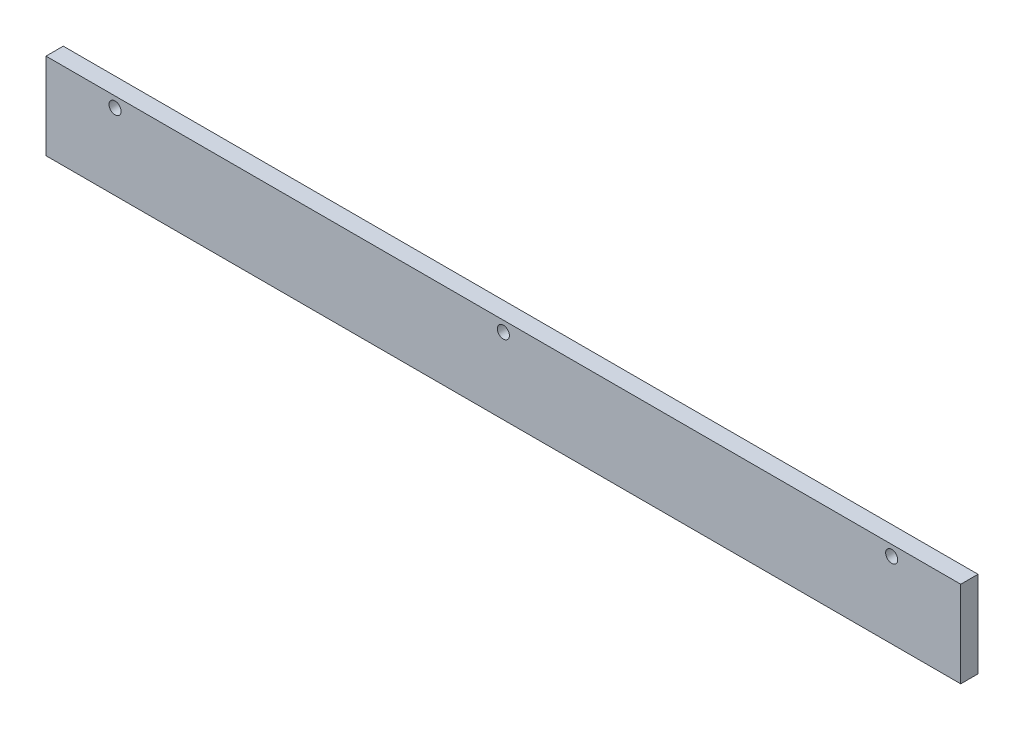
ISO-10303-21;
HEADER;
FILE_DESCRIPTION(('STEP AP214'),'2;1');
FILE_NAME('part.step','',(''),(''),'','','');
FILE_SCHEMA(('AUTOMOTIVE_DESIGN { 1 0 10303 214 1 1 1 1 }'));
ENDSEC;
DATA;
#1=APPLICATION_CONTEXT('core data for automotive mechanical design processes');
#2=APPLICATION_PROTOCOL_DEFINITION('international standard','automotive_design',2000,#1);
#3=PRODUCT_CONTEXT('',#1,'mechanical');
#4=PRODUCT('Part','Part','',(#3));
#5=PRODUCT_RELATED_PRODUCT_CATEGORY('part','',(#4));
#6=PRODUCT_DEFINITION_FORMATION('','',#4);
#7=PRODUCT_DEFINITION_CONTEXT('part definition',#1,'design');
#8=PRODUCT_DEFINITION('design','',#6,#7);
#9=PRODUCT_DEFINITION_SHAPE('','',#8);
#10=(LENGTH_UNIT() NAMED_UNIT(*) SI_UNIT(.MILLI.,.METRE.));
#11=(NAMED_UNIT(*) PLANE_ANGLE_UNIT() SI_UNIT($,.RADIAN.));
#12=(NAMED_UNIT(*) SI_UNIT($,.STERADIAN.) SOLID_ANGLE_UNIT());
#13=UNCERTAINTY_MEASURE_WITH_UNIT(LENGTH_MEASURE(1.E-05),#10,'distance_accuracy_value','');
#14=(GEOMETRIC_REPRESENTATION_CONTEXT(3) GLOBAL_UNCERTAINTY_ASSIGNED_CONTEXT((#13)) GLOBAL_UNIT_ASSIGNED_CONTEXT((#10,
#11,#12)) REPRESENTATION_CONTEXT('',''));
#15=CARTESIAN_POINT('',(0.,0.,0.));
#16=DIRECTION('',(0.,0.,1.));
#17=DIRECTION('',(1.,0.,0.));
#18=AXIS2_PLACEMENT_3D('',#15,#16,#17);
#19=CARTESIAN_POINT('',(-302.,34.802471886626,5.));
#20=DIRECTION('',(1.,0.,0.));
#21=DIRECTION('',(0.,0.,-1.));
#22=AXIS2_PLACEMENT_3D('',#19,#20,#21);
#23=PLANE('',#22);
#24=DIRECTION('',(0.,-1.,0.));
#25=VECTOR('',#24,1.);
#26=CARTESIAN_POINT('',(-302.,34.802471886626,0.));
#27=LINE('',#26,#25);
#28=CARTESIAN_POINT('',(-302.,34.802471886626,0.));
#29=VERTEX_POINT('',#28);
#30=CARTESIAN_POINT('',(-302.,9.80247188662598,0.));
#31=VERTEX_POINT('',#30);
#32=EDGE_CURVE('E79',#29,#31,#27,.T.);
#33=ORIENTED_EDGE('',*,*,#32,.T.);
#34=DIRECTION('',(0.,0.,-1.));
#35=VECTOR('',#34,1.);
#36=CARTESIAN_POINT('',(-302.,9.80247188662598,5.));
#37=LINE('',#36,#35);
#38=CARTESIAN_POINT('',(-302.,9.80247188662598,5.));
#39=VERTEX_POINT('',#38);
#40=EDGE_CURVE('E11',#39,#31,#37,.T.);
#41=ORIENTED_EDGE('',*,*,#40,.F.);
#42=DIRECTION('',(0.,-1.,0.));
#43=VECTOR('',#42,1.);
#44=CARTESIAN_POINT('',(-302.,34.802471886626,5.));
#45=LINE('',#44,#43);
#46=CARTESIAN_POINT('',(-302.,34.802471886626,5.));
#47=VERTEX_POINT('',#46);
#48=EDGE_CURVE('E67',#47,#39,#45,.T.);
#49=ORIENTED_EDGE('',*,*,#48,.F.);
#50=DIRECTION('',(0.,0.,-1.));
#51=VECTOR('',#50,1.);
#52=CARTESIAN_POINT('',(-302.,34.802471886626,5.));
#53=LINE('',#52,#51);
#54=EDGE_CURVE('E75',#47,#29,#53,.T.);
#55=ORIENTED_EDGE('',*,*,#54,.T.);
#56=EDGE_LOOP('',(#33,#41,#49,#55));
#57=FACE_BOUND('',#56,.T.);
#58=ADVANCED_FACE('F16',(#57),#23,.F.);
#59=CARTESIAN_POINT('',(-302.,9.80247188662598,5.));
#60=DIRECTION('',(0.,1.,0.));
#61=DIRECTION('',(0.,0.,1.));
#62=AXIS2_PLACEMENT_3D('',#59,#60,#61);
#63=PLANE('',#62);
#64=DIRECTION('',(1.,0.,0.));
#65=VECTOR('',#64,1.);
#66=CARTESIAN_POINT('',(-302.,9.80247188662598,0.));
#67=LINE('',#66,#65);
#68=CARTESIAN_POINT('',(-37.,9.80247188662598,0.));
#69=VERTEX_POINT('',#68);
#70=EDGE_CURVE('E71',#31,#69,#67,.T.);
#71=ORIENTED_EDGE('',*,*,#70,.T.);
#72=DIRECTION('',(0.,0.,-1.));
#73=VECTOR('',#72,1.);
#74=CARTESIAN_POINT('',(-37.,9.80247188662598,5.));
#75=LINE('',#74,#73);
#76=CARTESIAN_POINT('',(-37.,9.80247188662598,5.));
#77=VERTEX_POINT('',#76);
#78=EDGE_CURVE('E24',#77,#69,#75,.T.);
#79=ORIENTED_EDGE('',*,*,#78,.F.);
#80=DIRECTION('',(1.,0.,0.));
#81=VECTOR('',#80,1.);
#82=CARTESIAN_POINT('',(-302.,9.80247188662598,5.));
#83=LINE('',#82,#81);
#84=EDGE_CURVE('E62',#39,#77,#83,.T.);
#85=ORIENTED_EDGE('',*,*,#84,.F.);
#86=ORIENTED_EDGE('',*,*,#40,.T.);
#87=EDGE_LOOP('',(#71,#79,#85,#86));
#88=FACE_BOUND('',#87,.T.);
#89=ADVANCED_FACE('F70',(#88),#63,.F.);
#90=CARTESIAN_POINT('',(-37.,34.802471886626,5.));
#91=DIRECTION('',(-1.,0.,0.));
#92=DIRECTION('',(0.,0.,1.));
#93=AXIS2_PLACEMENT_3D('',#90,#91,#92);
#94=PLANE('',#93);
#95=DIRECTION('',(0.,1.,0.));
#96=VECTOR('',#95,1.);
#97=CARTESIAN_POINT('',(-37.,34.802471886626,0.));
#98=LINE('',#97,#96);
#99=CARTESIAN_POINT('',(-37.,34.802471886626,0.));
#100=VERTEX_POINT('',#99);
#101=EDGE_CURVE('E49',#69,#100,#98,.T.);
#102=ORIENTED_EDGE('',*,*,#101,.T.);
#103=DIRECTION('',(0.,0.,-1.));
#104=VECTOR('',#103,1.);
#105=CARTESIAN_POINT('',(-37.,34.802471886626,5.));
#106=LINE('',#105,#104);
#107=CARTESIAN_POINT('',(-37.,34.802471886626,5.));
#108=VERTEX_POINT('',#107);
#109=EDGE_CURVE('E72',#108,#100,#106,.T.);
#110=ORIENTED_EDGE('',*,*,#109,.F.);
#111=DIRECTION('',(0.,1.,0.));
#112=VECTOR('',#111,1.);
#113=CARTESIAN_POINT('',(-37.,34.802471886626,5.));
#114=LINE('',#113,#112);
#115=EDGE_CURVE('E65',#77,#108,#114,.T.);
#116=ORIENTED_EDGE('',*,*,#115,.F.);
#117=ORIENTED_EDGE('',*,*,#78,.T.);
#118=EDGE_LOOP('',(#102,#110,#116,#117));
#119=FACE_BOUND('',#118,.T.);
#120=ADVANCED_FACE('F73',(#119),#94,.F.);
#121=CARTESIAN_POINT('',(-302.,34.802471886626,5.));
#122=DIRECTION('',(0.,-1.,0.));
#123=DIRECTION('',(0.,0.,-1.));
#124=AXIS2_PLACEMENT_3D('',#121,#122,#123);
#125=PLANE('',#124);
#126=DIRECTION('',(-1.,0.,0.));
#127=VECTOR('',#126,1.);
#128=CARTESIAN_POINT('',(-302.,34.802471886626,0.));
#129=LINE('',#128,#127);
#130=EDGE_CURVE('E55',#100,#29,#129,.T.);
#131=ORIENTED_EDGE('',*,*,#130,.T.);
#132=ORIENTED_EDGE('',*,*,#54,.F.);
#133=DIRECTION('',(-1.,0.,0.));
#134=VECTOR('',#133,1.);
#135=CARTESIAN_POINT('',(-302.,34.802471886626,5.));
#136=LINE('',#135,#134);
#137=EDGE_CURVE('E32',#108,#47,#136,.T.);
#138=ORIENTED_EDGE('',*,*,#137,.F.);
#139=ORIENTED_EDGE('',*,*,#109,.T.);
#140=EDGE_LOOP('',(#131,#132,#138,#139));
#141=FACE_BOUND('',#140,.T.);
#142=ADVANCED_FACE('F87',(#141),#125,.F.);
#143=CARTESIAN_POINT('',(0.,0.,5.));
#144=DIRECTION('',(0.,0.,1.));
#145=DIRECTION('',(1.,0.,0.));
#146=AXIS2_PLACEMENT_3D('',#143,#144,#145);
#147=PLANE('',#146);
#148=CARTESIAN_POINT('',(-282.,31.802471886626,5.));
#149=DIRECTION('',(0.,0.,1.));
#150=DIRECTION('',(1.,0.,0.));
#151=AXIS2_PLACEMENT_3D('',#148,#149,#150);
#152=CIRCLE('',#151,1.74999999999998);
#153=CARTESIAN_POINT('',(-280.25,31.802471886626,5.));
#154=VERTEX_POINT('',#153);
#155=EDGE_CURVE('E107',#154,#154,#152,.T.);
#156=ORIENTED_EDGE('',*,*,#155,.F.);
#157=EDGE_LOOP('',(#156));
#158=FACE_BOUND('',#157,.T.);
#159=CARTESIAN_POINT('',(-169.5,31.802471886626,5.));
#160=DIRECTION('',(0.,0.,1.));
#161=DIRECTION('',(1.,0.,0.));
#162=AXIS2_PLACEMENT_3D('',#159,#160,#161);
#163=CIRCLE('',#162,1.75);
#164=CARTESIAN_POINT('',(-167.75,31.802471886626,5.));
#165=VERTEX_POINT('',#164);
#166=EDGE_CURVE('E101',#165,#165,#163,.T.);
#167=ORIENTED_EDGE('',*,*,#166,.F.);
#168=EDGE_LOOP('',(#167));
#169=FACE_BOUND('',#168,.T.);
#170=CARTESIAN_POINT('',(-57.,31.802471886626,5.));
#171=DIRECTION('',(0.,0.,1.));
#172=DIRECTION('',(1.,0.,0.));
#173=AXIS2_PLACEMENT_3D('',#170,#171,#172);
#174=CIRCLE('',#173,1.75);
#175=CARTESIAN_POINT('',(-55.25,31.802471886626,5.));
#176=VERTEX_POINT('',#175);
#177=EDGE_CURVE('E95',#176,#176,#174,.T.);
#178=ORIENTED_EDGE('',*,*,#177,.F.);
#179=EDGE_LOOP('',(#178));
#180=FACE_BOUND('',#179,.T.);
#181=ORIENTED_EDGE('',*,*,#48,.T.);
#182=ORIENTED_EDGE('',*,*,#84,.T.);
#183=ORIENTED_EDGE('',*,*,#115,.T.);
#184=ORIENTED_EDGE('',*,*,#137,.T.);
#185=EDGE_LOOP('',(#181,#182,#183,#184));
#186=FACE_BOUND('',#185,.T.);
#187=ADVANCED_FACE('F63',(#158,#169,#180,#186),#147,.T.);
#188=CARTESIAN_POINT('',(0.,0.,0.));
#189=DIRECTION('',(0.,0.,1.));
#190=DIRECTION('',(1.,0.,0.));
#191=AXIS2_PLACEMENT_3D('',#188,#189,#190);
#192=PLANE('',#191);
#193=CARTESIAN_POINT('',(-282.,31.802471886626,0.));
#194=DIRECTION('',(0.,0.,1.));
#195=DIRECTION('',(1.,0.,0.));
#196=AXIS2_PLACEMENT_3D('',#193,#194,#195);
#197=CIRCLE('',#196,1.74999999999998);
#198=CARTESIAN_POINT('',(-280.25,31.802471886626,0.));
#199=VERTEX_POINT('',#198);
#200=EDGE_CURVE('E104',#199,#199,#197,.T.);
#201=ORIENTED_EDGE('',*,*,#200,.T.);
#202=EDGE_LOOP('',(#201));
#203=FACE_BOUND('',#202,.T.);
#204=CARTESIAN_POINT('',(-169.5,31.802471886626,0.));
#205=DIRECTION('',(0.,0.,1.));
#206=DIRECTION('',(1.,0.,0.));
#207=AXIS2_PLACEMENT_3D('',#204,#205,#206);
#208=CIRCLE('',#207,1.75);
#209=CARTESIAN_POINT('',(-167.75,31.802471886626,0.));
#210=VERTEX_POINT('',#209);
#211=EDGE_CURVE('E98',#210,#210,#208,.T.);
#212=ORIENTED_EDGE('',*,*,#211,.T.);
#213=EDGE_LOOP('',(#212));
#214=FACE_BOUND('',#213,.T.);
#215=CARTESIAN_POINT('',(-57.,31.802471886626,0.));
#216=DIRECTION('',(0.,0.,1.));
#217=DIRECTION('',(1.,0.,0.));
#218=AXIS2_PLACEMENT_3D('',#215,#216,#217);
#219=CIRCLE('',#218,1.75);
#220=CARTESIAN_POINT('',(-55.25,31.802471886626,0.));
#221=VERTEX_POINT('',#220);
#222=EDGE_CURVE('E82',#221,#221,#219,.T.);
#223=ORIENTED_EDGE('',*,*,#222,.T.);
#224=EDGE_LOOP('',(#223));
#225=FACE_BOUND('',#224,.T.);
#226=ORIENTED_EDGE('',*,*,#32,.F.);
#227=ORIENTED_EDGE('',*,*,#130,.F.);
#228=ORIENTED_EDGE('',*,*,#101,.F.);
#229=ORIENTED_EDGE('',*,*,#70,.F.);
#230=EDGE_LOOP('',(#226,#227,#228,#229));
#231=FACE_BOUND('',#230,.T.);
#232=ADVANCED_FACE('F90',(#203,#214,#225,#231),#192,.F.);
#233=CARTESIAN_POINT('',(-57.,31.802471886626,5.));
#234=DIRECTION('',(0.,0.,1.));
#235=DIRECTION('',(1.,0.,0.));
#236=AXIS2_PLACEMENT_3D('',#233,#234,#235);
#237=CYLINDRICAL_SURFACE('',#236,1.75);
#238=ORIENTED_EDGE('',*,*,#222,.F.);
#239=EDGE_LOOP('',(#238));
#240=FACE_BOUND('',#239,.T.);
#241=ORIENTED_EDGE('',*,*,#177,.T.);
#242=EDGE_LOOP('',(#241));
#243=FACE_BOUND('',#242,.T.);
#244=ADVANCED_FACE('F120',(#240,#243),#237,.F.);
#245=CARTESIAN_POINT('',(-169.5,31.802471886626,5.));
#246=DIRECTION('',(0.,0.,1.));
#247=DIRECTION('',(1.,0.,0.));
#248=AXIS2_PLACEMENT_3D('',#245,#246,#247);
#249=CYLINDRICAL_SURFACE('',#248,1.75);
#250=ORIENTED_EDGE('',*,*,#211,.F.);
#251=EDGE_LOOP('',(#250));
#252=FACE_BOUND('',#251,.T.);
#253=ORIENTED_EDGE('',*,*,#166,.T.);
#254=EDGE_LOOP('',(#253));
#255=FACE_BOUND('',#254,.T.);
#256=ADVANCED_FACE('F122',(#252,#255),#249,.F.);
#257=CARTESIAN_POINT('',(-282.,31.802471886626,5.));
#258=DIRECTION('',(0.,0.,1.));
#259=DIRECTION('',(1.,0.,0.));
#260=AXIS2_PLACEMENT_3D('',#257,#258,#259);
#261=CYLINDRICAL_SURFACE('',#260,1.74999999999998);
#262=ORIENTED_EDGE('',*,*,#200,.F.);
#263=EDGE_LOOP('',(#262));
#264=FACE_BOUND('',#263,.T.);
#265=ORIENTED_EDGE('',*,*,#155,.T.);
#266=EDGE_LOOP('',(#265));
#267=FACE_BOUND('',#266,.T.);
#268=ADVANCED_FACE('F111',(#264,#267),#261,.F.);
#269=CLOSED_SHELL('',(#58,#89,#120,#142,#187,#232,#244,#256,#268));
#270=MANIFOLD_SOLID_BREP('B1',#269);
#271=ADVANCED_BREP_SHAPE_REPRESENTATION('',(#18,#270),#14);
#272=SHAPE_DEFINITION_REPRESENTATION(#9,#271);
ENDSEC;
END-ISO-10303-21;
